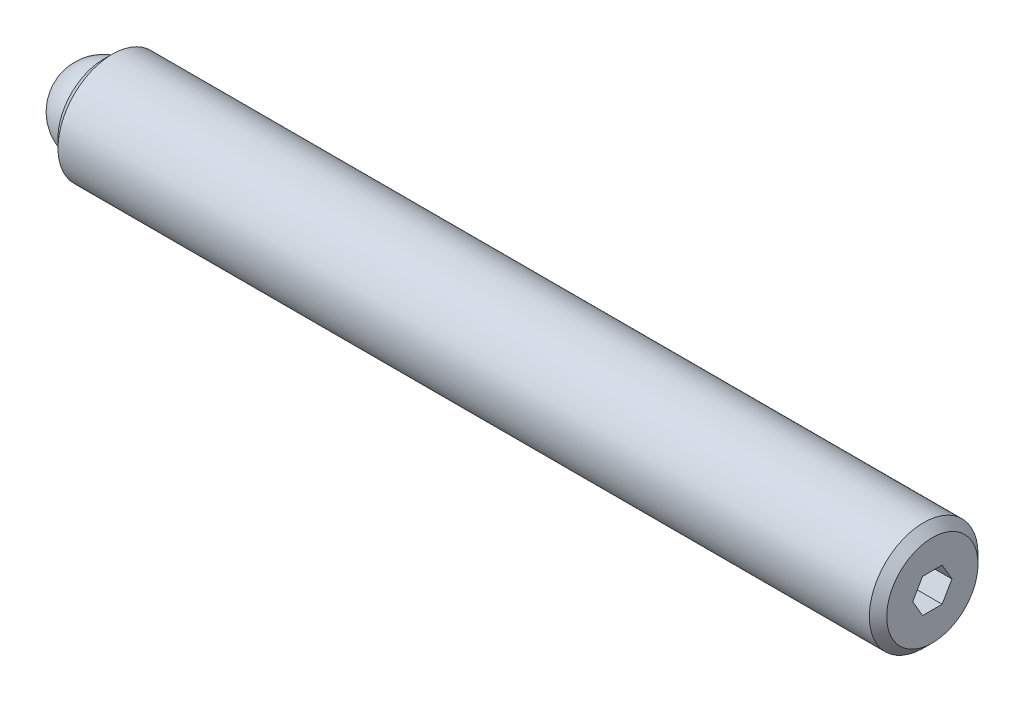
ISO-10303-21;
HEADER;
FILE_DESCRIPTION(('STEP AP214'),'2;1');
FILE_NAME('part.step','',(''),(''),'','','');
FILE_SCHEMA(('AUTOMOTIVE_DESIGN { 1 0 10303 214 1 1 1 1 }'));
ENDSEC;
DATA;
#1=APPLICATION_CONTEXT('core data for automotive mechanical design processes');
#2=APPLICATION_PROTOCOL_DEFINITION('international standard','automotive_design',2000,#1);
#3=PRODUCT_CONTEXT('',#1,'mechanical');
#4=PRODUCT('Part','Part','',(#3));
#5=PRODUCT_RELATED_PRODUCT_CATEGORY('part','',(#4));
#6=PRODUCT_DEFINITION_FORMATION('','',#4);
#7=PRODUCT_DEFINITION_CONTEXT('part definition',#1,'design');
#8=PRODUCT_DEFINITION('design','',#6,#7);
#9=PRODUCT_DEFINITION_SHAPE('','',#8);
#10=(LENGTH_UNIT() NAMED_UNIT(*) SI_UNIT(.MILLI.,.METRE.));
#11=(NAMED_UNIT(*) PLANE_ANGLE_UNIT() SI_UNIT($,.RADIAN.));
#12=(NAMED_UNIT(*) SI_UNIT($,.STERADIAN.) SOLID_ANGLE_UNIT());
#13=UNCERTAINTY_MEASURE_WITH_UNIT(LENGTH_MEASURE(1.E-05),#10,'distance_accuracy_value','');
#14=(GEOMETRIC_REPRESENTATION_CONTEXT(3) GLOBAL_UNCERTAINTY_ASSIGNED_CONTEXT((#13)) GLOBAL_UNIT_ASSIGNED_CONTEXT((#10,
#11,#12)) REPRESENTATION_CONTEXT('',''));
#15=CARTESIAN_POINT('',(0.,0.,0.));
#16=DIRECTION('',(0.,0.,1.));
#17=DIRECTION('',(1.,0.,0.));
#18=AXIS2_PLACEMENT_3D('',#15,#16,#17);
#19=CARTESIAN_POINT('',(0.,0.,0.));
#20=DIRECTION('',(0.,-1.,0.));
#21=DIRECTION('',(0.,0.,1.));
#22=AXIS2_PLACEMENT_3D('',#19,#20,#21);
#23=SPHERICAL_SURFACE('',#22,2.38125);
#24=CARTESIAN_POINT('',(0.,-2.38125,0.));
#25=VERTEX_POINT('',#24);
#26=VERTEX_LOOP('',#25);
#27=FACE_BOUND('',#26,.T.);
#28=ADVANCED_FACE('F41',(#27),#23,.T.);
#29=CLOSED_SHELL('',(#28));
#30=MANIFOLD_SOLID_BREP('B2',#29);
#31=CARTESIAN_POINT('',(48.41875,0.,0.));
#32=DIRECTION('',(-1.,0.,0.));
#33=DIRECTION('',(0.,0.,1.));
#34=AXIS2_PLACEMENT_3D('',#31,#32,#33);
#35=CYLINDRICAL_SURFACE('',#34,3.175);
#36=CARTESIAN_POINT('',(47.91075,0.,0.));
#37=DIRECTION('',(1.,0.,0.));
#38=DIRECTION('',(0.,0.,-1.));
#39=AXIS2_PLACEMENT_3D('',#36,#37,#38);
#40=CIRCLE('',#39,3.175);
#41=CARTESIAN_POINT('',(47.91075,0.,-3.175));
#42=VERTEX_POINT('',#41);
#43=EDGE_CURVE('E39',#42,#42,#40,.F.);
#44=ORIENTED_EDGE('',*,*,#43,.T.);
#45=EDGE_LOOP('',(#44));
#46=FACE_BOUND('',#45,.T.);
#47=CARTESIAN_POINT('',(0.508000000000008,0.,0.));
#48=DIRECTION('',(1.,0.,0.));
#49=DIRECTION('',(0.,0.,-1.));
#50=AXIS2_PLACEMENT_3D('',#47,#48,#49);
#51=CIRCLE('',#50,3.175);
#52=CARTESIAN_POINT('',(0.508000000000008,0.,-3.175));
#53=VERTEX_POINT('',#52);
#54=EDGE_CURVE('E176',#53,#53,#51,.T.);
#55=ORIENTED_EDGE('',*,*,#54,.T.);
#56=EDGE_LOOP('',(#55));
#57=FACE_BOUND('',#56,.T.);
#58=ADVANCED_FACE('F54',(#46,#57),#35,.T.);
#59=CARTESIAN_POINT('',(48.41875,0.,0.));
#60=DIRECTION('',(1.,0.,0.));
#61=DIRECTION('',(0.,0.,-1.));
#62=AXIS2_PLACEMENT_3D('',#59,#60,#61);
#63=PLANE('',#62);
#64=DIRECTION('',(0.,0.866025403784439,-0.5));
#65=VECTOR('',#64,1.);
#66=CARTESIAN_POINT('',(48.41875,-0.9921875,-0.572839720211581));
#67=LINE('',#66,#65);
#68=CARTESIAN_POINT('',(48.41875,-0.9921875,-0.572839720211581));
#69=VERTEX_POINT('',#68);
#70=CARTESIAN_POINT('',(48.41875,0.,-1.14567944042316));
#71=VERTEX_POINT('',#70);
#72=EDGE_CURVE('E77',#69,#71,#67,.T.);
#73=ORIENTED_EDGE('',*,*,#72,.F.);
#74=DIRECTION('',(0.,0.,-1.));
#75=VECTOR('',#74,1.);
#76=CARTESIAN_POINT('',(48.41875,-0.9921875,0.572839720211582));
#77=LINE('',#76,#75);
#78=CARTESIAN_POINT('',(48.41875,-0.9921875,0.572839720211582));
#79=VERTEX_POINT('',#78);
#80=EDGE_CURVE('E143',#79,#69,#77,.T.);
#81=ORIENTED_EDGE('',*,*,#80,.F.);
#82=DIRECTION('',(0.,-0.866025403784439,-0.5));
#83=VECTOR('',#82,1.);
#84=CARTESIAN_POINT('',(48.41875,0.,1.14567944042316));
#85=LINE('',#84,#83);
#86=CARTESIAN_POINT('',(48.41875,0.,1.14567944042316));
#87=VERTEX_POINT('',#86);
#88=EDGE_CURVE('E169',#87,#79,#85,.T.);
#89=ORIENTED_EDGE('',*,*,#88,.F.);
#90=DIRECTION('',(0.,-0.866025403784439,0.5));
#91=VECTOR('',#90,1.);
#92=CARTESIAN_POINT('',(48.41875,0.992187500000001,0.572839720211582));
#93=LINE('',#92,#91);
#94=CARTESIAN_POINT('',(48.41875,0.992187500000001,0.572839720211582));
#95=VERTEX_POINT('',#94);
#96=EDGE_CURVE('E166',#95,#87,#93,.T.);
#97=ORIENTED_EDGE('',*,*,#96,.F.);
#98=DIRECTION('',(0.,0.,1.));
#99=VECTOR('',#98,1.);
#100=CARTESIAN_POINT('',(48.41875,0.9921875,-0.572839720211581));
#101=LINE('',#100,#99);
#102=CARTESIAN_POINT('',(48.41875,0.9921875,-0.572839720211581));
#103=VERTEX_POINT('',#102);
#104=EDGE_CURVE('E163',#103,#95,#101,.T.);
#105=ORIENTED_EDGE('',*,*,#104,.F.);
#106=DIRECTION('',(0.,0.866025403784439,0.5));
#107=VECTOR('',#106,1.);
#108=CARTESIAN_POINT('',(48.41875,0.,-1.14567944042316));
#109=LINE('',#108,#107);
#110=EDGE_CURVE('E160',#71,#103,#109,.T.);
#111=ORIENTED_EDGE('',*,*,#110,.F.);
#112=EDGE_LOOP('',(#73,#81,#89,#97,#105,#111));
#113=FACE_BOUND('',#112,.T.);
#114=CARTESIAN_POINT('',(48.41875,0.,0.));
#115=DIRECTION('',(1.,0.,0.));
#116=DIRECTION('',(0.,0.,-1.));
#117=AXIS2_PLACEMENT_3D('',#114,#115,#116);
#118=CIRCLE('',#117,2.66699999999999);
#119=CARTESIAN_POINT('',(48.41875,0.,-2.66699999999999));
#120=VERTEX_POINT('',#119);
#121=EDGE_CURVE('E62',#120,#120,#118,.T.);
#122=ORIENTED_EDGE('',*,*,#121,.T.);
#123=EDGE_LOOP('',(#122));
#124=FACE_BOUND('',#123,.T.);
#125=ADVANCED_FACE('F193',(#113,#124),#63,.T.);
#126=CARTESIAN_POINT('',(0.,0.,0.));
#127=DIRECTION('',(1.,0.,0.));
#128=DIRECTION('',(0.,0.,-1.));
#129=AXIS2_PLACEMENT_3D('',#126,#127,#128);
#130=PLANE('',#129);
#131=CARTESIAN_POINT('',(0.,0.,0.));
#132=DIRECTION('',(-1.,0.,0.));
#133=DIRECTION('',(0.,0.,1.));
#134=AXIS2_PLACEMENT_3D('',#131,#132,#133);
#135=CIRCLE('',#134,2.38125);
#136=CARTESIAN_POINT('',(0.,2.38040333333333,-0.0634943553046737));
#137=VERTEX_POINT('',#136);
#138=CARTESIAN_POINT('',(0.,2.38040333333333,0.0634943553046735));
#139=VERTEX_POINT('',#138);
#140=EDGE_CURVE('E128',#137,#139,#135,.T.);
#141=ORIENTED_EDGE('',*,*,#140,.F.);
#142=CARTESIAN_POINT('',(0.,2.38125,0.));
#143=DIRECTION('',(-1.,0.,0.));
#144=DIRECTION('',(0.,0.,1.));
#145=AXIS2_PLACEMENT_3D('',#142,#143,#144);
#146=CIRCLE('',#145,0.0635000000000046);
#147=EDGE_CURVE('E117',#139,#137,#146,.T.);
#148=ORIENTED_EDGE('',*,*,#147,.F.);
#149=EDGE_LOOP('',(#141,#148));
#150=FACE_BOUND('',#149,.T.);
#151=CARTESIAN_POINT('',(0.,0.,0.));
#152=DIRECTION('',(1.,0.,0.));
#153=DIRECTION('',(0.,0.,-1.));
#154=AXIS2_PLACEMENT_3D('',#151,#152,#153);
#155=CIRCLE('',#154,2.667);
#156=CARTESIAN_POINT('',(0.,0.,-2.667));
#157=VERTEX_POINT('',#156);
#158=EDGE_CURVE('E188',#157,#157,#155,.F.);
#159=ORIENTED_EDGE('',*,*,#158,.T.);
#160=EDGE_LOOP('',(#159));
#161=FACE_BOUND('',#160,.T.);
#162=ADVANCED_FACE('F132',(#150,#161),#130,.F.);
#163=CARTESIAN_POINT('',(0.508000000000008,0.,0.));
#164=DIRECTION('',(1.,0.,0.));
#165=DIRECTION('',(0.,0.,-1.));
#166=AXIS2_PLACEMENT_3D('',#163,#164,#165);
#167=CONICAL_SURFACE('',#166,3.175,0.785398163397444);
#168=ORIENTED_EDGE('',*,*,#158,.F.);
#169=EDGE_LOOP('',(#168));
#170=FACE_BOUND('',#169,.T.);
#171=ORIENTED_EDGE('',*,*,#54,.F.);
#172=EDGE_LOOP('',(#171));
#173=FACE_BOUND('',#172,.T.);
#174=ADVANCED_FACE('F197',(#170,#173),#167,.T.);
#175=CARTESIAN_POINT('',(48.41875,0.,0.));
#176=DIRECTION('',(-1.,0.,0.));
#177=DIRECTION('',(0.,0.,1.));
#178=AXIS2_PLACEMENT_3D('',#175,#176,#177);
#179=CONICAL_SURFACE('',#178,2.66699999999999,0.785398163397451);
#180=ORIENTED_EDGE('',*,*,#43,.F.);
#181=EDGE_LOOP('',(#180));
#182=FACE_BOUND('',#181,.T.);
#183=ORIENTED_EDGE('',*,*,#121,.F.);
#184=EDGE_LOOP('',(#183));
#185=FACE_BOUND('',#184,.T.);
#186=ADVANCED_FACE('F56',(#182,#185),#179,.T.);
#187=CARTESIAN_POINT('',(46.13275,-0.9921875,-0.572839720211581));
#188=DIRECTION('',(0.,-0.5,-0.866025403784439));
#189=DIRECTION('',(0.,0.866025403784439,-0.5));
#190=AXIS2_PLACEMENT_3D('',#187,#188,#189);
#191=PLANE('',#190);
#192=ORIENTED_EDGE('',*,*,#72,.T.);
#193=DIRECTION('',(1.,0.,0.));
#194=VECTOR('',#193,1.);
#195=CARTESIAN_POINT('',(46.13275,0.,-1.14567944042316));
#196=LINE('',#195,#194);
#197=CARTESIAN_POINT('',(46.13275,0.,-1.14567944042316));
#198=VERTEX_POINT('',#197);
#199=EDGE_CURVE('E158',#198,#71,#196,.T.);
#200=ORIENTED_EDGE('',*,*,#199,.F.);
#201=DIRECTION('',(0.,0.866025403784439,-0.5));
#202=VECTOR('',#201,1.);
#203=CARTESIAN_POINT('',(46.13275,-0.9921875,-0.572839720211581));
#204=LINE('',#203,#202);
#205=CARTESIAN_POINT('',(46.13275,-0.9921875,-0.572839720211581));
#206=VERTEX_POINT('',#205);
#207=EDGE_CURVE('E139',#206,#198,#204,.T.);
#208=ORIENTED_EDGE('',*,*,#207,.F.);
#209=DIRECTION('',(1.,0.,0.));
#210=VECTOR('',#209,1.);
#211=CARTESIAN_POINT('',(46.13275,-0.9921875,-0.572839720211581));
#212=LINE('',#211,#210);
#213=EDGE_CURVE('E174',#206,#69,#212,.T.);
#214=ORIENTED_EDGE('',*,*,#213,.T.);
#215=EDGE_LOOP('',(#192,#200,#208,#214));
#216=FACE_BOUND('',#215,.T.);
#217=ADVANCED_FACE('F196',(#216),#191,.F.);
#218=CARTESIAN_POINT('',(46.13275,-0.9921875,0.572839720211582));
#219=DIRECTION('',(0.,-1.,0.));
#220=DIRECTION('',(0.,0.,-1.));
#221=AXIS2_PLACEMENT_3D('',#218,#219,#220);
#222=PLANE('',#221);
#223=ORIENTED_EDGE('',*,*,#80,.T.);
#224=ORIENTED_EDGE('',*,*,#213,.F.);
#225=DIRECTION('',(0.,0.,-1.));
#226=VECTOR('',#225,1.);
#227=CARTESIAN_POINT('',(46.13275,-0.9921875,0.572839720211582));
#228=LINE('',#227,#226);
#229=CARTESIAN_POINT('',(46.13275,-0.9921875,0.572839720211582));
#230=VERTEX_POINT('',#229);
#231=EDGE_CURVE('E155',#230,#206,#228,.T.);
#232=ORIENTED_EDGE('',*,*,#231,.F.);
#233=DIRECTION('',(1.,0.,0.));
#234=VECTOR('',#233,1.);
#235=CARTESIAN_POINT('',(46.13275,-0.9921875,0.572839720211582));
#236=LINE('',#235,#234);
#237=EDGE_CURVE('E177',#230,#79,#236,.T.);
#238=ORIENTED_EDGE('',*,*,#237,.T.);
#239=EDGE_LOOP('',(#223,#224,#232,#238));
#240=FACE_BOUND('',#239,.T.);
#241=ADVANCED_FACE('F203',(#240),#222,.F.);
#242=CARTESIAN_POINT('',(46.13275,0.,1.14567944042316));
#243=DIRECTION('',(0.,-0.5,0.866025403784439));
#244=DIRECTION('',(0.,-0.866025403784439,-0.5));
#245=AXIS2_PLACEMENT_3D('',#242,#243,#244);
#246=PLANE('',#245);
#247=ORIENTED_EDGE('',*,*,#88,.T.);
#248=ORIENTED_EDGE('',*,*,#237,.F.);
#249=DIRECTION('',(0.,-0.866025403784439,-0.5));
#250=VECTOR('',#249,1.);
#251=CARTESIAN_POINT('',(46.13275,0.,1.14567944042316));
#252=LINE('',#251,#250);
#253=CARTESIAN_POINT('',(46.13275,0.,1.14567944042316));
#254=VERTEX_POINT('',#253);
#255=EDGE_CURVE('E152',#254,#230,#252,.T.);
#256=ORIENTED_EDGE('',*,*,#255,.F.);
#257=DIRECTION('',(1.,0.,0.));
#258=VECTOR('',#257,1.);
#259=CARTESIAN_POINT('',(46.13275,0.,1.14567944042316));
#260=LINE('',#259,#258);
#261=EDGE_CURVE('E179',#254,#87,#260,.T.);
#262=ORIENTED_EDGE('',*,*,#261,.T.);
#263=EDGE_LOOP('',(#247,#248,#256,#262));
#264=FACE_BOUND('',#263,.T.);
#265=ADVANCED_FACE('F231',(#264),#246,.F.);
#266=CARTESIAN_POINT('',(46.13275,0.992187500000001,0.572839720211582));
#267=DIRECTION('',(0.,0.5,0.866025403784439));
#268=DIRECTION('',(0.,-0.866025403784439,0.5));
#269=AXIS2_PLACEMENT_3D('',#266,#267,#268);
#270=PLANE('',#269);
#271=ORIENTED_EDGE('',*,*,#96,.T.);
#272=ORIENTED_EDGE('',*,*,#261,.F.);
#273=DIRECTION('',(0.,-0.866025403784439,0.5));
#274=VECTOR('',#273,1.);
#275=CARTESIAN_POINT('',(46.13275,0.992187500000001,0.572839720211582));
#276=LINE('',#275,#274);
#277=CARTESIAN_POINT('',(46.13275,0.992187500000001,0.572839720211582));
#278=VERTEX_POINT('',#277);
#279=EDGE_CURVE('E149',#278,#254,#276,.T.);
#280=ORIENTED_EDGE('',*,*,#279,.F.);
#281=DIRECTION('',(1.,0.,0.));
#282=VECTOR('',#281,1.);
#283=CARTESIAN_POINT('',(46.13275,0.992187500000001,0.572839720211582));
#284=LINE('',#283,#282);
#285=EDGE_CURVE('E181',#278,#95,#284,.T.);
#286=ORIENTED_EDGE('',*,*,#285,.T.);
#287=EDGE_LOOP('',(#271,#272,#280,#286));
#288=FACE_BOUND('',#287,.T.);
#289=ADVANCED_FACE('F227',(#288),#270,.F.);
#290=CARTESIAN_POINT('',(46.13275,0.9921875,-0.572839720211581));
#291=DIRECTION('',(0.,1.,0.));
#292=DIRECTION('',(0.,0.,1.));
#293=AXIS2_PLACEMENT_3D('',#290,#291,#292);
#294=PLANE('',#293);
#295=ORIENTED_EDGE('',*,*,#104,.T.);
#296=ORIENTED_EDGE('',*,*,#285,.F.);
#297=DIRECTION('',(0.,0.,1.));
#298=VECTOR('',#297,1.);
#299=CARTESIAN_POINT('',(46.13275,0.9921875,-0.572839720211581));
#300=LINE('',#299,#298);
#301=CARTESIAN_POINT('',(46.13275,0.9921875,-0.572839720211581));
#302=VERTEX_POINT('',#301);
#303=EDGE_CURVE('E146',#302,#278,#300,.T.);
#304=ORIENTED_EDGE('',*,*,#303,.F.);
#305=DIRECTION('',(1.,0.,0.));
#306=VECTOR('',#305,1.);
#307=CARTESIAN_POINT('',(46.13275,0.9921875,-0.572839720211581));
#308=LINE('',#307,#306);
#309=EDGE_CURVE('E183',#302,#103,#308,.T.);
#310=ORIENTED_EDGE('',*,*,#309,.T.);
#311=EDGE_LOOP('',(#295,#296,#304,#310));
#312=FACE_BOUND('',#311,.T.);
#313=ADVANCED_FACE('F223',(#312),#294,.F.);
#314=CARTESIAN_POINT('',(46.13275,0.,-1.14567944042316));
#315=DIRECTION('',(0.,0.5,-0.866025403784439));
#316=DIRECTION('',(0.,0.866025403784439,0.5));
#317=AXIS2_PLACEMENT_3D('',#314,#315,#316);
#318=PLANE('',#317);
#319=ORIENTED_EDGE('',*,*,#110,.T.);
#320=ORIENTED_EDGE('',*,*,#309,.F.);
#321=DIRECTION('',(0.,0.866025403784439,0.5));
#322=VECTOR('',#321,1.);
#323=CARTESIAN_POINT('',(46.13275,0.,-1.14567944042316));
#324=LINE('',#323,#322);
#325=EDGE_CURVE('E142',#198,#302,#324,.T.);
#326=ORIENTED_EDGE('',*,*,#325,.F.);
#327=ORIENTED_EDGE('',*,*,#199,.T.);
#328=EDGE_LOOP('',(#319,#320,#326,#327));
#329=FACE_BOUND('',#328,.T.);
#330=ADVANCED_FACE('F219',(#329),#318,.F.);
#331=CARTESIAN_POINT('',(46.13275,0.,0.));
#332=DIRECTION('',(1.,0.,0.));
#333=DIRECTION('',(0.,0.,-1.));
#334=AXIS2_PLACEMENT_3D('',#331,#332,#333);
#335=PLANE('',#334);
#336=ORIENTED_EDGE('',*,*,#207,.T.);
#337=ORIENTED_EDGE('',*,*,#325,.T.);
#338=ORIENTED_EDGE('',*,*,#303,.T.);
#339=ORIENTED_EDGE('',*,*,#279,.T.);
#340=ORIENTED_EDGE('',*,*,#255,.T.);
#341=ORIENTED_EDGE('',*,*,#231,.T.);
#342=EDGE_LOOP('',(#336,#337,#338,#339,#340,#341));
#343=FACE_BOUND('',#342,.T.);
#344=ADVANCED_FACE('F222',(#343),#335,.T.);
#345=CARTESIAN_POINT('',(2.38125,0.,0.));
#346=DIRECTION('',(-1.,0.,0.));
#347=DIRECTION('',(0.,0.,1.));
#348=AXIS2_PLACEMENT_3D('',#345,#346,#347);
#349=CYLINDRICAL_SURFACE('',#348,2.38125);
#350=CARTESIAN_POINT('',(2.38125,0.,0.));
#351=DIRECTION('',(-1.,0.,0.));
#352=DIRECTION('',(0.,0.,1.));
#353=AXIS2_PLACEMENT_3D('',#350,#351,#352);
#354=CIRCLE('',#353,2.38125);
#355=CARTESIAN_POINT('',(2.38125,2.38040333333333,-0.0634943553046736));
#356=VERTEX_POINT('',#355);
#357=CARTESIAN_POINT('',(2.38125,2.38040333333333,0.0634943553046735));
#358=VERTEX_POINT('',#357);
#359=EDGE_CURVE('E130',#356,#358,#354,.T.);
#360=ORIENTED_EDGE('',*,*,#359,.F.);
#361=DIRECTION('',(-1.,0.,0.));
#362=VECTOR('',#361,1.);
#363=CARTESIAN_POINT('',(2.52362097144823,2.38040333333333,-0.0634943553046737));
#364=LINE('',#363,#362);
#365=EDGE_CURVE('E69',#356,#137,#364,.T.);
#366=ORIENTED_EDGE('',*,*,#365,.T.);
#367=ORIENTED_EDGE('',*,*,#140,.T.);
#368=DIRECTION('',(-1.,0.,0.));
#369=VECTOR('',#368,1.);
#370=CARTESIAN_POINT('',(2.52362097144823,2.38040333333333,0.0634943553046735));
#371=LINE('',#370,#369);
#372=EDGE_CURVE('E120',#358,#139,#371,.T.);
#373=ORIENTED_EDGE('',*,*,#372,.F.);
#374=EDGE_LOOP('',(#360,#366,#367,#373));
#375=FACE_BOUND('',#374,.T.);
#376=ADVANCED_FACE('F127',(#375),#349,.F.);
#377=CARTESIAN_POINT('',(2.38125,0.,0.));
#378=DIRECTION('',(-1.,0.,0.));
#379=DIRECTION('',(0.,0.,1.));
#380=AXIS2_PLACEMENT_3D('',#377,#378,#379);
#381=PLANE('',#380);
#382=ORIENTED_EDGE('',*,*,#359,.T.);
#383=CARTESIAN_POINT('',(2.38125,2.38125,0.));
#384=DIRECTION('',(-1.,0.,0.));
#385=DIRECTION('',(0.,0.,1.));
#386=AXIS2_PLACEMENT_3D('',#383,#384,#385);
#387=CIRCLE('',#386,0.0635000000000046);
#388=EDGE_CURVE('E134',#356,#358,#387,.F.);
#389=ORIENTED_EDGE('',*,*,#388,.F.);
#390=EDGE_LOOP('',(#382,#389));
#391=FACE_BOUND('',#390,.T.);
#392=ADVANCED_FACE('F244',(#391),#381,.T.);
#393=CARTESIAN_POINT('',(2.52362097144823,2.38125,0.));
#394=DIRECTION('',(-1.,0.,0.));
#395=DIRECTION('',(0.,0.,1.));
#396=AXIS2_PLACEMENT_3D('',#393,#394,#395);
#397=CYLINDRICAL_SURFACE('',#396,0.0635000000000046);
#398=ORIENTED_EDGE('',*,*,#388,.T.);
#399=ORIENTED_EDGE('',*,*,#372,.T.);
#400=ORIENTED_EDGE('',*,*,#147,.T.);
#401=ORIENTED_EDGE('',*,*,#365,.F.);
#402=EDGE_LOOP('',(#398,#399,#400,#401));
#403=FACE_BOUND('',#402,.T.);
#404=ADVANCED_FACE('F118',(#403),#397,.F.);
#405=CLOSED_SHELL('',(#58,#125,#162,#174,#186,#217,#241,#265,#289,#313,#330,#344,#376,#392,#404));
#406=MANIFOLD_SOLID_BREP('B6',#405);
#407=ADVANCED_BREP_SHAPE_REPRESENTATION('',(#18,#30,#406),#14);
#408=SHAPE_DEFINITION_REPRESENTATION(#9,#407);
ENDSEC;
END-ISO-10303-21;
